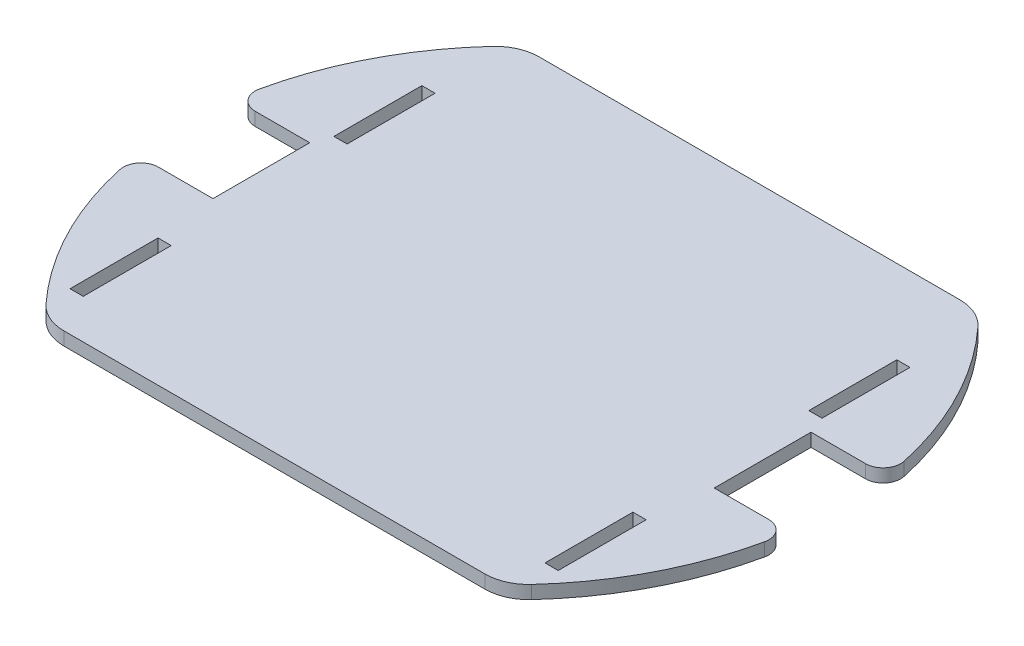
ISO-10303-21;
HEADER;
FILE_DESCRIPTION(('STEP AP214'),'2;1');
FILE_NAME('part.step','',(''),(''),'','','');
FILE_SCHEMA(('AUTOMOTIVE_DESIGN { 1 0 10303 214 1 1 1 1 }'));
ENDSEC;
DATA;
#1=APPLICATION_CONTEXT('core data for automotive mechanical design processes');
#2=APPLICATION_PROTOCOL_DEFINITION('international standard','automotive_design',2000,#1);
#3=PRODUCT_CONTEXT('',#1,'mechanical');
#4=PRODUCT('Part','Part','',(#3));
#5=PRODUCT_RELATED_PRODUCT_CATEGORY('part','',(#4));
#6=PRODUCT_DEFINITION_FORMATION('','',#4);
#7=PRODUCT_DEFINITION_CONTEXT('part definition',#1,'design');
#8=PRODUCT_DEFINITION('design','',#6,#7);
#9=PRODUCT_DEFINITION_SHAPE('','',#8);
#10=(LENGTH_UNIT() NAMED_UNIT(*) SI_UNIT(.MILLI.,.METRE.));
#11=(NAMED_UNIT(*) PLANE_ANGLE_UNIT() SI_UNIT($,.RADIAN.));
#12=(NAMED_UNIT(*) SI_UNIT($,.STERADIAN.) SOLID_ANGLE_UNIT());
#13=UNCERTAINTY_MEASURE_WITH_UNIT(LENGTH_MEASURE(1.E-05),#10,'distance_accuracy_value','');
#14=(GEOMETRIC_REPRESENTATION_CONTEXT(3) GLOBAL_UNCERTAINTY_ASSIGNED_CONTEXT((#13)) GLOBAL_UNIT_ASSIGNED_CONTEXT((#10,
#11,#12)) REPRESENTATION_CONTEXT('',''));
#15=CARTESIAN_POINT('',(0.,0.,0.));
#16=DIRECTION('',(0.,0.,1.));
#17=DIRECTION('',(1.,0.,0.));
#18=AXIS2_PLACEMENT_3D('',#15,#16,#17);
#19=CARTESIAN_POINT('',(0.,3.,0.));
#20=DIRECTION('',(0.,-1.,0.));
#21=DIRECTION('',(0.,0.,-1.));
#22=AXIS2_PLACEMENT_3D('',#19,#20,#21);
#23=CYLINDRICAL_SURFACE('',#22,75.);
#24=CARTESIAN_POINT('',(0.,3.,0.));
#25=DIRECTION('',(0.,1.,0.));
#26=DIRECTION('',(0.,0.,1.));
#27=AXIS2_PLACEMENT_3D('',#24,#25,#26);
#28=CIRCLE('',#27,75.);
#29=CARTESIAN_POINT('',(73.307119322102,3.,-15.8450704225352));
#30=VERTEX_POINT('',#29);
#31=CARTESIAN_POINT('',(55.2040325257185,3.,-50.7692307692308));
#32=VERTEX_POINT('',#31);
#33=EDGE_CURVE('E367',#30,#32,#28,.T.);
#34=ORIENTED_EDGE('',*,*,#33,.F.);
#35=DIRECTION('',(0.,-1.,0.));
#36=VECTOR('',#35,1.);
#37=CARTESIAN_POINT('',(73.307119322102,3.,-15.8450704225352));
#38=LINE('',#37,#36);
#39=CARTESIAN_POINT('',(73.307119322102,0.,-15.8450704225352));
#40=VERTEX_POINT('',#39);
#41=EDGE_CURVE('E46',#30,#40,#38,.T.);
#42=ORIENTED_EDGE('',*,*,#41,.T.);
#43=CARTESIAN_POINT('',(0.,0.,0.));
#44=DIRECTION('',(0.,1.,0.));
#45=DIRECTION('',(0.,0.,1.));
#46=AXIS2_PLACEMENT_3D('',#43,#44,#45);
#47=CIRCLE('',#46,75.);
#48=CARTESIAN_POINT('',(55.2040325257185,0.,-50.7692307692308));
#49=VERTEX_POINT('',#48);
#50=EDGE_CURVE('E360',#40,#49,#47,.T.);
#51=ORIENTED_EDGE('',*,*,#50,.T.);
#52=DIRECTION('',(0.,-1.,0.));
#53=VECTOR('',#52,1.);
#54=CARTESIAN_POINT('',(55.2040325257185,3.,-50.7692307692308));
#55=LINE('',#54,#53);
#56=EDGE_CURVE('E518',#49,#32,#55,.F.);
#57=ORIENTED_EDGE('',*,*,#56,.T.);
#58=EDGE_LOOP('',(#34,#42,#51,#57));
#59=FACE_BOUND('',#58,.T.);
#60=ADVANCED_FACE('F38',(#59),#23,.T.);
#61=CARTESIAN_POINT('',(-52.0480547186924,3.,-54.));
#62=DIRECTION('',(0.,0.,1.));
#63=DIRECTION('',(1.,0.,0.));
#64=AXIS2_PLACEMENT_3D('',#61,#62,#63);
#65=PLANE('',#64);
#66=DIRECTION('',(-1.,0.,0.));
#67=VECTOR('',#66,1.);
#68=CARTESIAN_POINT('',(-52.0480547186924,0.,-54.));
#69=LINE('',#68,#67);
#70=CARTESIAN_POINT('',(47.8434948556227,0.,-54.));
#71=VERTEX_POINT('',#70);
#72=CARTESIAN_POINT('',(-47.8434948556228,0.,-54.));
#73=VERTEX_POINT('',#72);
#74=EDGE_CURVE('E399',#71,#73,#69,.T.);
#75=ORIENTED_EDGE('',*,*,#74,.T.);
#76=DIRECTION('',(0.,-1.,0.));
#77=VECTOR('',#76,1.);
#78=CARTESIAN_POINT('',(-47.8434948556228,3.,-54.));
#79=LINE('',#78,#77);
#80=CARTESIAN_POINT('',(-47.8434948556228,3.,-54.));
#81=VERTEX_POINT('',#80);
#82=EDGE_CURVE('E497',#73,#81,#79,.F.);
#83=ORIENTED_EDGE('',*,*,#82,.T.);
#84=DIRECTION('',(-1.,0.,0.));
#85=VECTOR('',#84,1.);
#86=CARTESIAN_POINT('',(-52.0480547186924,3.,-54.));
#87=LINE('',#86,#85);
#88=CARTESIAN_POINT('',(47.8434948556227,3.,-54.));
#89=VERTEX_POINT('',#88);
#90=EDGE_CURVE('E369',#89,#81,#87,.T.);
#91=ORIENTED_EDGE('',*,*,#90,.F.);
#92=DIRECTION('',(0.,-1.,0.));
#93=VECTOR('',#92,1.);
#94=CARTESIAN_POINT('',(47.8434948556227,3.,-54.));
#95=LINE('',#94,#93);
#96=EDGE_CURVE('E494',#89,#71,#95,.T.);
#97=ORIENTED_EDGE('',*,*,#96,.T.);
#98=EDGE_LOOP('',(#75,#83,#91,#97));
#99=FACE_BOUND('',#98,.T.);
#100=ADVANCED_FACE('F568',(#99),#65,.F.);
#101=CARTESIAN_POINT('',(0.,3.,0.));
#102=DIRECTION('',(0.,-1.,0.));
#103=DIRECTION('',(0.,0.,-1.));
#104=AXIS2_PLACEMENT_3D('',#101,#102,#103);
#105=CYLINDRICAL_SURFACE('',#104,75.);
#106=CARTESIAN_POINT('',(0.,0.,0.));
#107=DIRECTION('',(0.,1.,0.));
#108=DIRECTION('',(0.,0.,1.));
#109=AXIS2_PLACEMENT_3D('',#106,#107,#108);
#110=CIRCLE('',#109,75.);
#111=CARTESIAN_POINT('',(-55.2040325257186,0.,-50.7692307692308));
#112=VERTEX_POINT('',#111);
#113=CARTESIAN_POINT('',(-73.307119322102,0.,-15.8450704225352));
#114=VERTEX_POINT('',#113);
#115=EDGE_CURVE('E402',#112,#114,#110,.T.);
#116=ORIENTED_EDGE('',*,*,#115,.T.);
#117=DIRECTION('',(0.,-1.,0.));
#118=VECTOR('',#117,1.);
#119=CARTESIAN_POINT('',(-73.307119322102,3.,-15.8450704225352));
#120=LINE('',#119,#118);
#121=CARTESIAN_POINT('',(-73.307119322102,3.,-15.8450704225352));
#122=VERTEX_POINT('',#121);
#123=EDGE_CURVE('E544',#114,#122,#120,.F.);
#124=ORIENTED_EDGE('',*,*,#123,.T.);
#125=CARTESIAN_POINT('',(0.,3.,0.));
#126=DIRECTION('',(0.,1.,0.));
#127=DIRECTION('',(0.,0.,1.));
#128=AXIS2_PLACEMENT_3D('',#125,#126,#127);
#129=CIRCLE('',#128,75.);
#130=CARTESIAN_POINT('',(-55.2040325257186,3.,-50.7692307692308));
#131=VERTEX_POINT('',#130);
#132=EDGE_CURVE('E373',#131,#122,#129,.T.);
#133=ORIENTED_EDGE('',*,*,#132,.F.);
#134=DIRECTION('',(0.,-1.,0.));
#135=VECTOR('',#134,1.);
#136=CARTESIAN_POINT('',(-55.2040325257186,3.,-50.7692307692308));
#137=LINE('',#136,#135);
#138=EDGE_CURVE('E481',#131,#112,#137,.T.);
#139=ORIENTED_EDGE('',*,*,#138,.T.);
#140=EDGE_LOOP('',(#116,#124,#133,#139));
#141=FACE_BOUND('',#140,.T.);
#142=ADVANCED_FACE('F576',(#141),#105,.T.);
#143=CARTESIAN_POINT('',(-74.1889479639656,3.,-11.));
#144=DIRECTION('',(0.,0.,-1.));
#145=DIRECTION('',(-1.,0.,0.));
#146=AXIS2_PLACEMENT_3D('',#143,#144,#145);
#147=PLANE('',#146);
#148=DIRECTION('',(1.,0.,0.));
#149=VECTOR('',#148,1.);
#150=CARTESIAN_POINT('',(-74.1889479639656,3.,-11.));
#151=LINE('',#150,#149);
#152=CARTESIAN_POINT('',(-69.3974062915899,3.,-11.));
#153=VERTEX_POINT('',#152);
#154=CARTESIAN_POINT('',(-57.,3.,-11.));
#155=VERTEX_POINT('',#154);
#156=EDGE_CURVE('E376',#153,#155,#151,.T.);
#157=ORIENTED_EDGE('',*,*,#156,.F.);
#158=DIRECTION('',(0.,-1.,0.));
#159=VECTOR('',#158,1.);
#160=CARTESIAN_POINT('',(-69.3974062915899,3.,-11.));
#161=LINE('',#160,#159);
#162=CARTESIAN_POINT('',(-69.3974062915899,0.,-11.));
#163=VERTEX_POINT('',#162);
#164=EDGE_CURVE('E541',#153,#163,#161,.T.);
#165=ORIENTED_EDGE('',*,*,#164,.T.);
#166=DIRECTION('',(1.,0.,0.));
#167=VECTOR('',#166,1.);
#168=CARTESIAN_POINT('',(-74.1889479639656,0.,-11.));
#169=LINE('',#168,#167);
#170=CARTESIAN_POINT('',(-57.,0.,-11.));
#171=VERTEX_POINT('',#170);
#172=EDGE_CURVE('E405',#163,#171,#169,.T.);
#173=ORIENTED_EDGE('',*,*,#172,.T.);
#174=DIRECTION('',(0.,-1.,0.));
#175=VECTOR('',#174,1.);
#176=CARTESIAN_POINT('',(-57.,3.,-11.));
#177=LINE('',#176,#175);
#178=EDGE_CURVE('E433',#155,#171,#177,.T.);
#179=ORIENTED_EDGE('',*,*,#178,.F.);
#180=EDGE_LOOP('',(#157,#165,#173,#179));
#181=FACE_BOUND('',#180,.T.);
#182=ADVANCED_FACE('F585',(#181),#147,.F.);
#183=CARTESIAN_POINT('',(-57.,3.,-11.));
#184=DIRECTION('',(1.,0.,0.));
#185=DIRECTION('',(0.,0.,-1.));
#186=AXIS2_PLACEMENT_3D('',#183,#184,#185);
#187=PLANE('',#186);
#188=DIRECTION('',(0.,0.,1.));
#189=VECTOR('',#188,1.);
#190=CARTESIAN_POINT('',(-57.,0.,-11.));
#191=LINE('',#190,#189);
#192=CARTESIAN_POINT('',(-57.,0.,11.));
#193=VERTEX_POINT('',#192);
#194=EDGE_CURVE('E407',#171,#193,#191,.T.);
#195=ORIENTED_EDGE('',*,*,#194,.T.);
#196=DIRECTION('',(0.,-1.,0.));
#197=VECTOR('',#196,1.);
#198=CARTESIAN_POINT('',(-57.,3.,11.));
#199=LINE('',#198,#197);
#200=CARTESIAN_POINT('',(-57.,3.,11.));
#201=VERTEX_POINT('',#200);
#202=EDGE_CURVE('E430',#201,#193,#199,.T.);
#203=ORIENTED_EDGE('',*,*,#202,.F.);
#204=DIRECTION('',(0.,0.,1.));
#205=VECTOR('',#204,1.);
#206=CARTESIAN_POINT('',(-57.,3.,-11.));
#207=LINE('',#206,#205);
#208=EDGE_CURVE('E378',#155,#201,#207,.T.);
#209=ORIENTED_EDGE('',*,*,#208,.F.);
#210=ORIENTED_EDGE('',*,*,#178,.T.);
#211=EDGE_LOOP('',(#195,#203,#209,#210));
#212=FACE_BOUND('',#211,.T.);
#213=ADVANCED_FACE('F591',(#212),#187,.F.);
#214=CARTESIAN_POINT('',(-57.,3.,11.));
#215=DIRECTION('',(0.,0.,1.));
#216=DIRECTION('',(1.,0.,0.));
#217=AXIS2_PLACEMENT_3D('',#214,#215,#216);
#218=PLANE('',#217);
#219=DIRECTION('',(-1.,0.,0.));
#220=VECTOR('',#219,1.);
#221=CARTESIAN_POINT('',(-57.,0.,11.));
#222=LINE('',#221,#220);
#223=CARTESIAN_POINT('',(-69.3974062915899,0.,11.));
#224=VERTEX_POINT('',#223);
#225=EDGE_CURVE('E409',#193,#224,#222,.T.);
#226=ORIENTED_EDGE('',*,*,#225,.T.);
#227=DIRECTION('',(0.,-1.,0.));
#228=VECTOR('',#227,1.);
#229=CARTESIAN_POINT('',(-69.3974062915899,3.,11.));
#230=LINE('',#229,#228);
#231=CARTESIAN_POINT('',(-69.3974062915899,3.,11.));
#232=VERTEX_POINT('',#231);
#233=EDGE_CURVE('E532',#224,#232,#230,.F.);
#234=ORIENTED_EDGE('',*,*,#233,.T.);
#235=DIRECTION('',(-1.,0.,0.));
#236=VECTOR('',#235,1.);
#237=CARTESIAN_POINT('',(-57.,3.,11.));
#238=LINE('',#237,#236);
#239=EDGE_CURVE('E380',#201,#232,#238,.T.);
#240=ORIENTED_EDGE('',*,*,#239,.F.);
#241=ORIENTED_EDGE('',*,*,#202,.T.);
#242=EDGE_LOOP('',(#226,#234,#240,#241));
#243=FACE_BOUND('',#242,.T.);
#244=ADVANCED_FACE('F901',(#243),#218,.F.);
#245=CARTESIAN_POINT('',(0.,3.,0.));
#246=DIRECTION('',(0.,-1.,0.));
#247=DIRECTION('',(0.,0.,-1.));
#248=AXIS2_PLACEMENT_3D('',#245,#246,#247);
#249=CYLINDRICAL_SURFACE('',#248,75.);
#250=CARTESIAN_POINT('',(0.,3.,0.));
#251=DIRECTION('',(0.,1.,0.));
#252=DIRECTION('',(0.,0.,1.));
#253=AXIS2_PLACEMENT_3D('',#250,#251,#252);
#254=CIRCLE('',#253,75.);
#255=CARTESIAN_POINT('',(-73.307119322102,3.,15.8450704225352));
#256=VERTEX_POINT('',#255);
#257=CARTESIAN_POINT('',(-55.2040325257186,3.,50.7692307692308));
#258=VERTEX_POINT('',#257);
#259=EDGE_CURVE('E383',#256,#258,#254,.T.);
#260=ORIENTED_EDGE('',*,*,#259,.F.);
#261=DIRECTION('',(0.,-1.,0.));
#262=VECTOR('',#261,1.);
#263=CARTESIAN_POINT('',(-73.307119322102,3.,15.8450704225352));
#264=LINE('',#263,#262);
#265=CARTESIAN_POINT('',(-73.307119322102,0.,15.8450704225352));
#266=VERTEX_POINT('',#265);
#267=EDGE_CURVE('E521',#256,#266,#264,.T.);
#268=ORIENTED_EDGE('',*,*,#267,.T.);
#269=CARTESIAN_POINT('',(0.,0.,0.));
#270=DIRECTION('',(0.,1.,0.));
#271=DIRECTION('',(0.,0.,1.));
#272=AXIS2_PLACEMENT_3D('',#269,#270,#271);
#273=CIRCLE('',#272,75.);
#274=CARTESIAN_POINT('',(-55.2040325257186,0.,50.7692307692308));
#275=VERTEX_POINT('',#274);
#276=EDGE_CURVE('E412',#266,#275,#273,.T.);
#277=ORIENTED_EDGE('',*,*,#276,.T.);
#278=DIRECTION('',(0.,-1.,0.));
#279=VECTOR('',#278,1.);
#280=CARTESIAN_POINT('',(-55.2040325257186,3.,50.7692307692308));
#281=LINE('',#280,#279);
#282=EDGE_CURVE('E512',#275,#258,#281,.F.);
#283=ORIENTED_EDGE('',*,*,#282,.T.);
#284=EDGE_LOOP('',(#260,#268,#277,#283));
#285=FACE_BOUND('',#284,.T.);
#286=ADVANCED_FACE('F601',(#285),#249,.T.);
#287=CARTESIAN_POINT('',(-52.0480547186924,3.,54.));
#288=DIRECTION('',(0.,0.,-1.));
#289=DIRECTION('',(-1.,0.,0.));
#290=AXIS2_PLACEMENT_3D('',#287,#288,#289);
#291=PLANE('',#290);
#292=DIRECTION('',(1.,0.,0.));
#293=VECTOR('',#292,1.);
#294=CARTESIAN_POINT('',(-52.0480547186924,3.,54.));
#295=LINE('',#294,#293);
#296=CARTESIAN_POINT('',(-47.8434948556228,3.,54.));
#297=VERTEX_POINT('',#296);
#298=CARTESIAN_POINT('',(47.8434948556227,3.,54.));
#299=VERTEX_POINT('',#298);
#300=EDGE_CURVE('E385',#297,#299,#295,.T.);
#301=ORIENTED_EDGE('',*,*,#300,.F.);
#302=DIRECTION('',(0.,-1.,0.));
#303=VECTOR('',#302,1.);
#304=CARTESIAN_POINT('',(-47.8434948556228,3.,54.));
#305=LINE('',#304,#303);
#306=CARTESIAN_POINT('',(-47.8434948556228,0.,54.));
#307=VERTEX_POINT('',#306);
#308=EDGE_CURVE('E509',#297,#307,#305,.T.);
#309=ORIENTED_EDGE('',*,*,#308,.T.);
#310=DIRECTION('',(1.,0.,0.));
#311=VECTOR('',#310,1.);
#312=CARTESIAN_POINT('',(-52.0480547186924,0.,54.));
#313=LINE('',#312,#311);
#314=CARTESIAN_POINT('',(47.8434948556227,0.,54.));
#315=VERTEX_POINT('',#314);
#316=EDGE_CURVE('E414',#307,#315,#313,.T.);
#317=ORIENTED_EDGE('',*,*,#316,.T.);
#318=DIRECTION('',(0.,-1.,0.));
#319=VECTOR('',#318,1.);
#320=CARTESIAN_POINT('',(47.8434948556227,3.,54.));
#321=LINE('',#320,#319);
#322=EDGE_CURVE('E507',#315,#299,#321,.F.);
#323=ORIENTED_EDGE('',*,*,#322,.T.);
#324=EDGE_LOOP('',(#301,#309,#317,#323));
#325=FACE_BOUND('',#324,.T.);
#326=ADVANCED_FACE('F612',(#325),#291,.F.);
#327=CARTESIAN_POINT('',(0.,3.,0.));
#328=DIRECTION('',(0.,-1.,0.));
#329=DIRECTION('',(0.,0.,-1.));
#330=AXIS2_PLACEMENT_3D('',#327,#328,#329);
#331=CYLINDRICAL_SURFACE('',#330,75.);
#332=CARTESIAN_POINT('',(0.,0.,0.));
#333=DIRECTION('',(0.,1.,0.));
#334=DIRECTION('',(0.,0.,1.));
#335=AXIS2_PLACEMENT_3D('',#332,#333,#334);
#336=CIRCLE('',#335,75.);
#337=CARTESIAN_POINT('',(55.2040325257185,0.,50.7692307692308));
#338=VERTEX_POINT('',#337);
#339=CARTESIAN_POINT('',(73.307119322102,0.,15.8450704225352));
#340=VERTEX_POINT('',#339);
#341=EDGE_CURVE('E417',#338,#340,#336,.T.);
#342=ORIENTED_EDGE('',*,*,#341,.T.);
#343=DIRECTION('',(0.,-1.,0.));
#344=VECTOR('',#343,1.);
#345=CARTESIAN_POINT('',(73.307119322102,3.,15.8450704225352));
#346=LINE('',#345,#344);
#347=CARTESIAN_POINT('',(73.307119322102,3.,15.8450704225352));
#348=VERTEX_POINT('',#347);
#349=EDGE_CURVE('E549',#340,#348,#346,.F.);
#350=ORIENTED_EDGE('',*,*,#349,.T.);
#351=CARTESIAN_POINT('',(0.,3.,0.));
#352=DIRECTION('',(0.,1.,0.));
#353=DIRECTION('',(0.,0.,1.));
#354=AXIS2_PLACEMENT_3D('',#351,#352,#353);
#355=CIRCLE('',#354,75.);
#356=CARTESIAN_POINT('',(55.2040325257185,3.,50.7692307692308));
#357=VERTEX_POINT('',#356);
#358=EDGE_CURVE('E388',#357,#348,#355,.T.);
#359=ORIENTED_EDGE('',*,*,#358,.F.);
#360=DIRECTION('',(0.,-1.,0.));
#361=VECTOR('',#360,1.);
#362=CARTESIAN_POINT('',(55.2040325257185,3.,50.7692307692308));
#363=LINE('',#362,#361);
#364=EDGE_CURVE('E515',#357,#338,#363,.T.);
#365=ORIENTED_EDGE('',*,*,#364,.T.);
#366=EDGE_LOOP('',(#342,#350,#359,#365));
#367=FACE_BOUND('',#366,.T.);
#368=ADVANCED_FACE('F620',(#367),#331,.T.);
#369=CARTESIAN_POINT('',(57.,3.,11.));
#370=DIRECTION('',(0.,0.,1.));
#371=DIRECTION('',(1.,0.,0.));
#372=AXIS2_PLACEMENT_3D('',#369,#370,#371);
#373=PLANE('',#372);
#374=DIRECTION('',(-1.,0.,0.));
#375=VECTOR('',#374,1.);
#376=CARTESIAN_POINT('',(57.,3.,11.));
#377=LINE('',#376,#375);
#378=CARTESIAN_POINT('',(69.3974062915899,3.,11.));
#379=VERTEX_POINT('',#378);
#380=CARTESIAN_POINT('',(57.,3.,11.));
#381=VERTEX_POINT('',#380);
#382=EDGE_CURVE('E391',#379,#381,#377,.T.);
#383=ORIENTED_EDGE('',*,*,#382,.F.);
#384=DIRECTION('',(0.,-1.,0.));
#385=VECTOR('',#384,1.);
#386=CARTESIAN_POINT('',(69.3974062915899,3.,11.));
#387=LINE('',#386,#385);
#388=CARTESIAN_POINT('',(69.3974062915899,0.,11.));
#389=VERTEX_POINT('',#388);
#390=EDGE_CURVE('E546',#379,#389,#387,.T.);
#391=ORIENTED_EDGE('',*,*,#390,.T.);
#392=DIRECTION('',(-1.,0.,0.));
#393=VECTOR('',#392,1.);
#394=CARTESIAN_POINT('',(57.,0.,11.));
#395=LINE('',#394,#393);
#396=CARTESIAN_POINT('',(57.,0.,11.));
#397=VERTEX_POINT('',#396);
#398=EDGE_CURVE('E420',#389,#397,#395,.T.);
#399=ORIENTED_EDGE('',*,*,#398,.T.);
#400=DIRECTION('',(0.,-1.,0.));
#401=VECTOR('',#400,1.);
#402=CARTESIAN_POINT('',(57.,3.,11.));
#403=LINE('',#402,#401);
#404=EDGE_CURVE('E427',#381,#397,#403,.T.);
#405=ORIENTED_EDGE('',*,*,#404,.F.);
#406=EDGE_LOOP('',(#383,#391,#399,#405));
#407=FACE_BOUND('',#406,.T.);
#408=ADVANCED_FACE('F629',(#407),#373,.F.);
#409=CARTESIAN_POINT('',(57.,3.,-11.));
#410=DIRECTION('',(-1.,0.,0.));
#411=DIRECTION('',(0.,0.,1.));
#412=AXIS2_PLACEMENT_3D('',#409,#410,#411);
#413=PLANE('',#412);
#414=DIRECTION('',(0.,0.,-1.));
#415=VECTOR('',#414,1.);
#416=CARTESIAN_POINT('',(57.,0.,-11.));
#417=LINE('',#416,#415);
#418=CARTESIAN_POINT('',(57.,0.,-11.));
#419=VERTEX_POINT('',#418);
#420=EDGE_CURVE('E422',#397,#419,#417,.T.);
#421=ORIENTED_EDGE('',*,*,#420,.T.);
#422=DIRECTION('',(0.,-1.,0.));
#423=VECTOR('',#422,1.);
#424=CARTESIAN_POINT('',(57.,3.,-11.));
#425=LINE('',#424,#423);
#426=CARTESIAN_POINT('',(57.,3.,-11.));
#427=VERTEX_POINT('',#426);
#428=EDGE_CURVE('E397',#427,#419,#425,.T.);
#429=ORIENTED_EDGE('',*,*,#428,.F.);
#430=DIRECTION('',(0.,0.,-1.));
#431=VECTOR('',#430,1.);
#432=CARTESIAN_POINT('',(57.,3.,-11.));
#433=LINE('',#432,#431);
#434=EDGE_CURVE('E393',#381,#427,#433,.T.);
#435=ORIENTED_EDGE('',*,*,#434,.F.);
#436=ORIENTED_EDGE('',*,*,#404,.T.);
#437=EDGE_LOOP('',(#421,#429,#435,#436));
#438=FACE_BOUND('',#437,.T.);
#439=ADVANCED_FACE('F635',(#438),#413,.F.);
#440=CARTESIAN_POINT('',(74.1889479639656,3.,-11.));
#441=DIRECTION('',(0.,0.,-1.));
#442=DIRECTION('',(-1.,0.,0.));
#443=AXIS2_PLACEMENT_3D('',#440,#441,#442);
#444=PLANE('',#443);
#445=DIRECTION('',(1.,0.,0.));
#446=VECTOR('',#445,1.);
#447=CARTESIAN_POINT('',(74.1889479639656,0.,-11.));
#448=LINE('',#447,#446);
#449=CARTESIAN_POINT('',(69.3974062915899,0.,-11.));
#450=VERTEX_POINT('',#449);
#451=EDGE_CURVE('E370',#419,#450,#448,.T.);
#452=ORIENTED_EDGE('',*,*,#451,.T.);
#453=DIRECTION('',(0.,-1.,0.));
#454=VECTOR('',#453,1.);
#455=CARTESIAN_POINT('',(69.3974062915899,3.,-11.));
#456=LINE('',#455,#454);
#457=CARTESIAN_POINT('',(69.3974062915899,3.,-11.));
#458=VERTEX_POINT('',#457);
#459=EDGE_CURVE('E11',#450,#458,#456,.F.);
#460=ORIENTED_EDGE('',*,*,#459,.T.);
#461=DIRECTION('',(1.,0.,0.));
#462=VECTOR('',#461,1.);
#463=CARTESIAN_POINT('',(74.1889479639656,3.,-11.));
#464=LINE('',#463,#462);
#465=EDGE_CURVE('E395',#427,#458,#464,.T.);
#466=ORIENTED_EDGE('',*,*,#465,.F.);
#467=ORIENTED_EDGE('',*,*,#428,.T.);
#468=EDGE_LOOP('',(#452,#460,#466,#467));
#469=FACE_BOUND('',#468,.T.);
#470=ADVANCED_FACE('F858',(#469),#444,.F.);
#471=CARTESIAN_POINT('',(0.,3.,0.));
#472=DIRECTION('',(0.,1.,0.));
#473=DIRECTION('',(0.,0.,1.));
#474=AXIS2_PLACEMENT_3D('',#471,#472,#473);
#475=PLANE('',#474);
#476=DIRECTION('',(0.,0.,1.));
#477=VECTOR('',#476,1.);
#478=CARTESIAN_POINT('',(52.5,3.,25.));
#479=LINE('',#478,#477);
#480=CARTESIAN_POINT('',(52.5,3.,25.));
#481=VERTEX_POINT('',#480);
#482=CARTESIAN_POINT('',(52.5,3.,45.));
#483=VERTEX_POINT('',#482);
#484=EDGE_CURVE('E307',#481,#483,#479,.T.);
#485=ORIENTED_EDGE('',*,*,#484,.F.);
#486=DIRECTION('',(-1.,0.,0.));
#487=VECTOR('',#486,1.);
#488=CARTESIAN_POINT('',(52.5,3.,25.));
#489=LINE('',#488,#487);
#490=CARTESIAN_POINT('',(55.5,3.,25.));
#491=VERTEX_POINT('',#490);
#492=EDGE_CURVE('E316',#491,#481,#489,.T.);
#493=ORIENTED_EDGE('',*,*,#492,.F.);
#494=DIRECTION('',(0.,0.,-1.));
#495=VECTOR('',#494,1.);
#496=CARTESIAN_POINT('',(55.5,3.,25.));
#497=LINE('',#496,#495);
#498=CARTESIAN_POINT('',(55.5,3.,45.));
#499=VERTEX_POINT('',#498);
#500=EDGE_CURVE('E313',#499,#491,#497,.T.);
#501=ORIENTED_EDGE('',*,*,#500,.F.);
#502=DIRECTION('',(1.,0.,0.));
#503=VECTOR('',#502,1.);
#504=CARTESIAN_POINT('',(52.5,3.,45.));
#505=LINE('',#504,#503);
#506=EDGE_CURVE('E309',#483,#499,#505,.T.);
#507=ORIENTED_EDGE('',*,*,#506,.F.);
#508=EDGE_LOOP('',(#485,#493,#501,#507));
#509=FACE_BOUND('',#508,.T.);
#510=DIRECTION('',(-1.,0.,0.));
#511=VECTOR('',#510,1.);
#512=CARTESIAN_POINT('',(-52.5,3.,-35.));
#513=LINE('',#512,#511);
#514=CARTESIAN_POINT('',(-52.5,3.,-35.));
#515=VERTEX_POINT('',#514);
#516=CARTESIAN_POINT('',(-55.5,3.,-35.));
#517=VERTEX_POINT('',#516);
#518=EDGE_CURVE('E304',#515,#517,#513,.T.);
#519=ORIENTED_EDGE('',*,*,#518,.F.);
#520=DIRECTION('',(0.,0.,-1.));
#521=VECTOR('',#520,1.);
#522=CARTESIAN_POINT('',(-52.5,3.,-35.));
#523=LINE('',#522,#521);
#524=CARTESIAN_POINT('',(-52.5,3.,-15.));
#525=VERTEX_POINT('',#524);
#526=EDGE_CURVE('E336',#525,#515,#523,.T.);
#527=ORIENTED_EDGE('',*,*,#526,.F.);
#528=DIRECTION('',(1.,0.,0.));
#529=VECTOR('',#528,1.);
#530=CARTESIAN_POINT('',(-52.5,3.,-15.));
#531=LINE('',#530,#529);
#532=CARTESIAN_POINT('',(-55.5,3.,-15.));
#533=VERTEX_POINT('',#532);
#534=EDGE_CURVE('E333',#533,#525,#531,.T.);
#535=ORIENTED_EDGE('',*,*,#534,.F.);
#536=DIRECTION('',(0.,0.,1.));
#537=VECTOR('',#536,1.);
#538=CARTESIAN_POINT('',(-55.5,3.,-35.));
#539=LINE('',#538,#537);
#540=EDGE_CURVE('E330',#517,#533,#539,.T.);
#541=ORIENTED_EDGE('',*,*,#540,.F.);
#542=EDGE_LOOP('',(#519,#527,#535,#541));
#543=FACE_BOUND('',#542,.T.);
#544=DIRECTION('',(-1.,0.,0.));
#545=VECTOR('',#544,1.);
#546=CARTESIAN_POINT('',(-52.5,3.,25.));
#547=LINE('',#546,#545);
#548=CARTESIAN_POINT('',(-52.5,3.,25.));
#549=VERTEX_POINT('',#548);
#550=CARTESIAN_POINT('',(-55.5,3.,25.));
#551=VERTEX_POINT('',#550);
#552=EDGE_CURVE('E292',#549,#551,#547,.T.);
#553=ORIENTED_EDGE('',*,*,#552,.F.);
#554=DIRECTION('',(0.,0.,-1.));
#555=VECTOR('',#554,1.);
#556=CARTESIAN_POINT('',(-52.5,3.,25.));
#557=LINE('',#556,#555);
#558=CARTESIAN_POINT('',(-52.5,3.,45.));
#559=VERTEX_POINT('',#558);
#560=EDGE_CURVE('E297',#559,#549,#557,.T.);
#561=ORIENTED_EDGE('',*,*,#560,.F.);
#562=DIRECTION('',(1.,0.,0.));
#563=VECTOR('',#562,1.);
#564=CARTESIAN_POINT('',(-52.5,3.,45.));
#565=LINE('',#564,#563);
#566=CARTESIAN_POINT('',(-55.5,3.,45.));
#567=VERTEX_POINT('',#566);
#568=EDGE_CURVE('E276',#567,#559,#565,.T.);
#569=ORIENTED_EDGE('',*,*,#568,.F.);
#570=DIRECTION('',(0.,0.,1.));
#571=VECTOR('',#570,1.);
#572=CARTESIAN_POINT('',(-55.5,3.,25.));
#573=LINE('',#572,#571);
#574=EDGE_CURVE('E287',#551,#567,#573,.T.);
#575=ORIENTED_EDGE('',*,*,#574,.F.);
#576=EDGE_LOOP('',(#553,#561,#569,#575));
#577=FACE_BOUND('',#576,.T.);
#578=DIRECTION('',(0.,0.,1.));
#579=VECTOR('',#578,1.);
#580=CARTESIAN_POINT('',(52.5,3.,-35.));
#581=LINE('',#580,#579);
#582=CARTESIAN_POINT('',(52.5,3.,-35.));
#583=VERTEX_POINT('',#582);
#584=CARTESIAN_POINT('',(52.5,3.,-15.));
#585=VERTEX_POINT('',#584);
#586=EDGE_CURVE('E322',#583,#585,#581,.T.);
#587=ORIENTED_EDGE('',*,*,#586,.F.);
#588=DIRECTION('',(-1.,0.,0.));
#589=VECTOR('',#588,1.);
#590=CARTESIAN_POINT('',(52.5,3.,-35.));
#591=LINE('',#590,#589);
#592=CARTESIAN_POINT('',(55.5,3.,-35.));
#593=VERTEX_POINT('',#592);
#594=EDGE_CURVE('E354',#593,#583,#591,.T.);
#595=ORIENTED_EDGE('',*,*,#594,.F.);
#596=DIRECTION('',(0.,0.,-1.));
#597=VECTOR('',#596,1.);
#598=CARTESIAN_POINT('',(55.5,3.,-35.));
#599=LINE('',#598,#597);
#600=CARTESIAN_POINT('',(55.5,3.,-15.));
#601=VERTEX_POINT('',#600);
#602=EDGE_CURVE('E351',#601,#593,#599,.T.);
#603=ORIENTED_EDGE('',*,*,#602,.F.);
#604=DIRECTION('',(1.,0.,0.));
#605=VECTOR('',#604,1.);
#606=CARTESIAN_POINT('',(52.5,3.,-15.));
#607=LINE('',#606,#605);
#608=EDGE_CURVE('E348',#585,#601,#607,.T.);
#609=ORIENTED_EDGE('',*,*,#608,.F.);
#610=EDGE_LOOP('',(#587,#595,#603,#609));
#611=FACE_BOUND('',#610,.T.);
#612=ORIENTED_EDGE('',*,*,#239,.T.);
#613=CARTESIAN_POINT('',(-69.3974062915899,3.,15.));
#614=DIRECTION('',(0.,1.,0.));
#615=DIRECTION('',(0.,0.,1.));
#616=AXIS2_PLACEMENT_3D('',#613,#614,#615);
#617=CIRCLE('',#616,4.);
#618=EDGE_CURVE('E539',#232,#256,#617,.T.);
#619=ORIENTED_EDGE('',*,*,#618,.T.);
#620=ORIENTED_EDGE('',*,*,#259,.T.);
#621=CARTESIAN_POINT('',(-47.8434948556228,3.,44.));
#622=DIRECTION('',(0.,1.,0.));
#623=DIRECTION('',(0.,0.,1.));
#624=AXIS2_PLACEMENT_3D('',#621,#622,#623);
#625=CIRCLE('',#624,10.);
#626=EDGE_CURVE('E503',#258,#297,#625,.T.);
#627=ORIENTED_EDGE('',*,*,#626,.T.);
#628=ORIENTED_EDGE('',*,*,#300,.T.);
#629=CARTESIAN_POINT('',(47.8434948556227,3.,44.));
#630=DIRECTION('',(0.,1.,0.));
#631=DIRECTION('',(0.,0.,1.));
#632=AXIS2_PLACEMENT_3D('',#629,#630,#631);
#633=CIRCLE('',#632,10.);
#634=EDGE_CURVE('E501',#299,#357,#633,.T.);
#635=ORIENTED_EDGE('',*,*,#634,.T.);
#636=ORIENTED_EDGE('',*,*,#358,.T.);
#637=CARTESIAN_POINT('',(69.3974062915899,3.,15.));
#638=DIRECTION('',(0.,1.,0.));
#639=DIRECTION('',(0.,0.,1.));
#640=AXIS2_PLACEMENT_3D('',#637,#638,#639);
#641=CIRCLE('',#640,4.);
#642=EDGE_CURVE('E535',#348,#379,#641,.T.);
#643=ORIENTED_EDGE('',*,*,#642,.T.);
#644=ORIENTED_EDGE('',*,*,#382,.T.);
#645=ORIENTED_EDGE('',*,*,#434,.T.);
#646=ORIENTED_EDGE('',*,*,#465,.T.);
#647=CARTESIAN_POINT('',(69.3974062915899,3.,-15.));
#648=DIRECTION('',(0.,1.,0.));
#649=DIRECTION('',(0.,0.,1.));
#650=AXIS2_PLACEMENT_3D('',#647,#648,#649);
#651=CIRCLE('',#650,4.);
#652=EDGE_CURVE('E53',#458,#30,#651,.T.);
#653=ORIENTED_EDGE('',*,*,#652,.T.);
#654=ORIENTED_EDGE('',*,*,#33,.T.);
#655=CARTESIAN_POINT('',(47.8434948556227,3.,-44.));
#656=DIRECTION('',(0.,1.,0.));
#657=DIRECTION('',(0.,0.,1.));
#658=AXIS2_PLACEMENT_3D('',#655,#656,#657);
#659=CIRCLE('',#658,10.);
#660=EDGE_CURVE('E499',#32,#89,#659,.T.);
#661=ORIENTED_EDGE('',*,*,#660,.T.);
#662=ORIENTED_EDGE('',*,*,#90,.T.);
#663=CARTESIAN_POINT('',(-47.8434948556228,3.,-44.));
#664=DIRECTION('',(0.,1.,0.));
#665=DIRECTION('',(0.,0.,1.));
#666=AXIS2_PLACEMENT_3D('',#663,#664,#665);
#667=CIRCLE('',#666,10.);
#668=EDGE_CURVE('E505',#81,#131,#667,.T.);
#669=ORIENTED_EDGE('',*,*,#668,.T.);
#670=ORIENTED_EDGE('',*,*,#132,.T.);
#671=CARTESIAN_POINT('',(-69.3974062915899,3.,-15.));
#672=DIRECTION('',(0.,1.,0.));
#673=DIRECTION('',(0.,0.,1.));
#674=AXIS2_PLACEMENT_3D('',#671,#672,#673);
#675=CIRCLE('',#674,4.);
#676=EDGE_CURVE('E537',#122,#153,#675,.T.);
#677=ORIENTED_EDGE('',*,*,#676,.T.);
#678=ORIENTED_EDGE('',*,*,#156,.T.);
#679=ORIENTED_EDGE('',*,*,#208,.T.);
#680=EDGE_LOOP('',(#612,#619,#620,#627,#628,#635,#636,#643,#644,#645,#646,#653,#654,#661,#662,
#669,#670,#677,#678,#679));
#681=FACE_BOUND('',#680,.T.);
#682=ADVANCED_FACE('F294',(#509,#543,#577,#611,#681),#475,.T.);
#683=CARTESIAN_POINT('',(0.,0.,0.));
#684=DIRECTION('',(0.,1.,0.));
#685=DIRECTION('',(0.,0.,1.));
#686=AXIS2_PLACEMENT_3D('',#683,#684,#685);
#687=PLANE('',#686);
#688=DIRECTION('',(-1.,0.,0.));
#689=VECTOR('',#688,1.);
#690=CARTESIAN_POINT('',(0.,0.,25.));
#691=LINE('',#690,#689);
#692=CARTESIAN_POINT('',(55.5,0.,25.));
#693=VERTEX_POINT('',#692);
#694=CARTESIAN_POINT('',(52.5,0.,25.));
#695=VERTEX_POINT('',#694);
#696=EDGE_CURVE('E475',#693,#695,#691,.T.);
#697=ORIENTED_EDGE('',*,*,#696,.T.);
#698=DIRECTION('',(0.,0.,1.));
#699=VECTOR('',#698,1.);
#700=CARTESIAN_POINT('',(52.5,0.,0.));
#701=LINE('',#700,#699);
#702=CARTESIAN_POINT('',(52.5,0.,45.));
#703=VERTEX_POINT('',#702);
#704=EDGE_CURVE('E478',#695,#703,#701,.T.);
#705=ORIENTED_EDGE('',*,*,#704,.T.);
#706=DIRECTION('',(1.,0.,0.));
#707=VECTOR('',#706,1.);
#708=CARTESIAN_POINT('',(0.,0.,45.));
#709=LINE('',#708,#707);
#710=CARTESIAN_POINT('',(55.5,0.,45.));
#711=VERTEX_POINT('',#710);
#712=EDGE_CURVE('E469',#703,#711,#709,.T.);
#713=ORIENTED_EDGE('',*,*,#712,.T.);
#714=DIRECTION('',(0.,0.,-1.));
#715=VECTOR('',#714,1.);
#716=CARTESIAN_POINT('',(55.5,0.,0.));
#717=LINE('',#716,#715);
#718=EDGE_CURVE('E472',#711,#693,#717,.T.);
#719=ORIENTED_EDGE('',*,*,#718,.T.);
#720=EDGE_LOOP('',(#697,#705,#713,#719));
#721=FACE_BOUND('',#720,.T.);
#722=DIRECTION('',(0.,0.,-1.));
#723=VECTOR('',#722,1.);
#724=CARTESIAN_POINT('',(-52.5,0.,0.));
#725=LINE('',#724,#723);
#726=CARTESIAN_POINT('',(-52.5,0.,-15.));
#727=VERTEX_POINT('',#726);
#728=CARTESIAN_POINT('',(-52.5,0.,-35.));
#729=VERTEX_POINT('',#728);
#730=EDGE_CURVE('E463',#727,#729,#725,.T.);
#731=ORIENTED_EDGE('',*,*,#730,.T.);
#732=DIRECTION('',(-1.,0.,0.));
#733=VECTOR('',#732,1.);
#734=CARTESIAN_POINT('',(0.,0.,-35.));
#735=LINE('',#734,#733);
#736=CARTESIAN_POINT('',(-55.5,0.,-35.));
#737=VERTEX_POINT('',#736);
#738=EDGE_CURVE('E466',#729,#737,#735,.T.);
#739=ORIENTED_EDGE('',*,*,#738,.T.);
#740=DIRECTION('',(0.,0.,1.));
#741=VECTOR('',#740,1.);
#742=CARTESIAN_POINT('',(-55.5,0.,0.));
#743=LINE('',#742,#741);
#744=CARTESIAN_POINT('',(-55.5,0.,-15.));
#745=VERTEX_POINT('',#744);
#746=EDGE_CURVE('E457',#737,#745,#743,.T.);
#747=ORIENTED_EDGE('',*,*,#746,.T.);
#748=DIRECTION('',(1.,0.,0.));
#749=VECTOR('',#748,1.);
#750=CARTESIAN_POINT('',(0.,0.,-15.));
#751=LINE('',#750,#749);
#752=EDGE_CURVE('E460',#745,#727,#751,.T.);
#753=ORIENTED_EDGE('',*,*,#752,.T.);
#754=EDGE_LOOP('',(#731,#739,#747,#753));
#755=FACE_BOUND('',#754,.T.);
#756=DIRECTION('',(0.,0.,-1.));
#757=VECTOR('',#756,1.);
#758=CARTESIAN_POINT('',(-52.5,0.,0.));
#759=LINE('',#758,#757);
#760=CARTESIAN_POINT('',(-52.5,0.,45.));
#761=VERTEX_POINT('',#760);
#762=CARTESIAN_POINT('',(-52.5,0.,25.));
#763=VERTEX_POINT('',#762);
#764=EDGE_CURVE('E451',#761,#763,#759,.T.);
#765=ORIENTED_EDGE('',*,*,#764,.T.);
#766=DIRECTION('',(-1.,0.,0.));
#767=VECTOR('',#766,1.);
#768=CARTESIAN_POINT('',(0.,0.,25.));
#769=LINE('',#768,#767);
#770=CARTESIAN_POINT('',(-55.5,0.,25.));
#771=VERTEX_POINT('',#770);
#772=EDGE_CURVE('E454',#763,#771,#769,.T.);
#773=ORIENTED_EDGE('',*,*,#772,.T.);
#774=DIRECTION('',(0.,0.,1.));
#775=VECTOR('',#774,1.);
#776=CARTESIAN_POINT('',(-55.5,0.,0.));
#777=LINE('',#776,#775);
#778=CARTESIAN_POINT('',(-55.5,0.,45.));
#779=VERTEX_POINT('',#778);
#780=EDGE_CURVE('E448',#771,#779,#777,.T.);
#781=ORIENTED_EDGE('',*,*,#780,.T.);
#782=DIRECTION('',(1.,0.,0.));
#783=VECTOR('',#782,1.);
#784=CARTESIAN_POINT('',(0.,0.,45.));
#785=LINE('',#784,#783);
#786=EDGE_CURVE('E279',#779,#761,#785,.T.);
#787=ORIENTED_EDGE('',*,*,#786,.T.);
#788=EDGE_LOOP('',(#765,#773,#781,#787));
#789=FACE_BOUND('',#788,.T.);
#790=DIRECTION('',(-1.,0.,0.));
#791=VECTOR('',#790,1.);
#792=CARTESIAN_POINT('',(0.,0.,-35.));
#793=LINE('',#792,#791);
#794=CARTESIAN_POINT('',(55.5,0.,-35.));
#795=VERTEX_POINT('',#794);
#796=CARTESIAN_POINT('',(52.5,0.,-35.));
#797=VERTEX_POINT('',#796);
#798=EDGE_CURVE('E442',#795,#797,#793,.T.);
#799=ORIENTED_EDGE('',*,*,#798,.T.);
#800=DIRECTION('',(0.,0.,1.));
#801=VECTOR('',#800,1.);
#802=CARTESIAN_POINT('',(52.5,0.,0.));
#803=LINE('',#802,#801);
#804=CARTESIAN_POINT('',(52.5,0.,-15.));
#805=VERTEX_POINT('',#804);
#806=EDGE_CURVE('E445',#797,#805,#803,.T.);
#807=ORIENTED_EDGE('',*,*,#806,.T.);
#808=DIRECTION('',(1.,0.,0.));
#809=VECTOR('',#808,1.);
#810=CARTESIAN_POINT('',(0.,0.,-15.));
#811=LINE('',#810,#809);
#812=CARTESIAN_POINT('',(55.5,0.,-15.));
#813=VERTEX_POINT('',#812);
#814=EDGE_CURVE('E436',#805,#813,#811,.T.);
#815=ORIENTED_EDGE('',*,*,#814,.T.);
#816=DIRECTION('',(0.,0.,-1.));
#817=VECTOR('',#816,1.);
#818=CARTESIAN_POINT('',(55.5,0.,0.));
#819=LINE('',#818,#817);
#820=EDGE_CURVE('E439',#813,#795,#819,.T.);
#821=ORIENTED_EDGE('',*,*,#820,.T.);
#822=EDGE_LOOP('',(#799,#807,#815,#821));
#823=FACE_BOUND('',#822,.T.);
#824=ORIENTED_EDGE('',*,*,#276,.F.);
#825=CARTESIAN_POINT('',(-69.3974062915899,0.,15.));
#826=DIRECTION('',(0.,1.,0.));
#827=DIRECTION('',(0.,0.,1.));
#828=AXIS2_PLACEMENT_3D('',#825,#826,#827);
#829=CIRCLE('',#828,4.);
#830=EDGE_CURVE('E530',#266,#224,#829,.F.);
#831=ORIENTED_EDGE('',*,*,#830,.T.);
#832=ORIENTED_EDGE('',*,*,#225,.F.);
#833=ORIENTED_EDGE('',*,*,#194,.F.);
#834=ORIENTED_EDGE('',*,*,#172,.F.);
#835=CARTESIAN_POINT('',(-69.3974062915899,0.,-15.));
#836=DIRECTION('',(0.,1.,0.));
#837=DIRECTION('',(0.,0.,1.));
#838=AXIS2_PLACEMENT_3D('',#835,#836,#837);
#839=CIRCLE('',#838,4.);
#840=EDGE_CURVE('E528',#163,#114,#839,.F.);
#841=ORIENTED_EDGE('',*,*,#840,.T.);
#842=ORIENTED_EDGE('',*,*,#115,.F.);
#843=CARTESIAN_POINT('',(-47.8434948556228,0.,-44.));
#844=DIRECTION('',(0.,1.,0.));
#845=DIRECTION('',(0.,0.,1.));
#846=AXIS2_PLACEMENT_3D('',#843,#844,#845);
#847=CIRCLE('',#846,10.);
#848=EDGE_CURVE('E492',#112,#73,#847,.F.);
#849=ORIENTED_EDGE('',*,*,#848,.T.);
#850=ORIENTED_EDGE('',*,*,#74,.F.);
#851=CARTESIAN_POINT('',(47.8434948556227,0.,-44.));
#852=DIRECTION('',(0.,1.,0.));
#853=DIRECTION('',(0.,0.,1.));
#854=AXIS2_PLACEMENT_3D('',#851,#852,#853);
#855=CIRCLE('',#854,10.);
#856=EDGE_CURVE('E484',#71,#49,#855,.F.);
#857=ORIENTED_EDGE('',*,*,#856,.T.);
#858=ORIENTED_EDGE('',*,*,#50,.F.);
#859=CARTESIAN_POINT('',(69.3974062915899,0.,-15.));
#860=DIRECTION('',(0.,1.,0.));
#861=DIRECTION('',(0.,0.,1.));
#862=AXIS2_PLACEMENT_3D('',#859,#860,#861);
#863=CIRCLE('',#862,4.);
#864=EDGE_CURVE('E524',#40,#450,#863,.F.);
#865=ORIENTED_EDGE('',*,*,#864,.T.);
#866=ORIENTED_EDGE('',*,*,#451,.F.);
#867=ORIENTED_EDGE('',*,*,#420,.F.);
#868=ORIENTED_EDGE('',*,*,#398,.F.);
#869=CARTESIAN_POINT('',(69.3974062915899,0.,15.));
#870=DIRECTION('',(0.,1.,0.));
#871=DIRECTION('',(0.,0.,1.));
#872=AXIS2_PLACEMENT_3D('',#869,#870,#871);
#873=CIRCLE('',#872,4.);
#874=EDGE_CURVE('E526',#389,#340,#873,.F.);
#875=ORIENTED_EDGE('',*,*,#874,.T.);
#876=ORIENTED_EDGE('',*,*,#341,.F.);
#877=CARTESIAN_POINT('',(47.8434948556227,0.,44.));
#878=DIRECTION('',(0.,1.,0.));
#879=DIRECTION('',(0.,0.,1.));
#880=AXIS2_PLACEMENT_3D('',#877,#878,#879);
#881=CIRCLE('',#880,10.);
#882=EDGE_CURVE('E487',#338,#315,#881,.F.);
#883=ORIENTED_EDGE('',*,*,#882,.T.);
#884=ORIENTED_EDGE('',*,*,#316,.F.);
#885=CARTESIAN_POINT('',(-47.8434948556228,0.,44.));
#886=DIRECTION('',(0.,1.,0.));
#887=DIRECTION('',(0.,0.,1.));
#888=AXIS2_PLACEMENT_3D('',#885,#886,#887);
#889=CIRCLE('',#888,10.);
#890=EDGE_CURVE('E489',#307,#275,#889,.F.);
#891=ORIENTED_EDGE('',*,*,#890,.T.);
#892=EDGE_LOOP('',(#824,#831,#832,#833,#834,#841,#842,#849,#850,#857,#858,#865,#866,#867,#868,
#875,#876,#883,#884,#891));
#893=FACE_BOUND('',#892,.T.);
#894=ADVANCED_FACE('F557',(#721,#755,#789,#823,#893),#687,.F.);
#895=CARTESIAN_POINT('',(52.5,-7.,-35.));
#896=DIRECTION('',(-1.,0.,0.));
#897=DIRECTION('',(0.,0.,1.));
#898=AXIS2_PLACEMENT_3D('',#895,#896,#897);
#899=PLANE('',#898);
#900=DIRECTION('',(0.,1.,0.));
#901=VECTOR('',#900,1.);
#902=CARTESIAN_POINT('',(52.5,-7.,-35.));
#903=LINE('',#902,#901);
#904=EDGE_CURVE('E358',#797,#583,#903,.T.);
#905=ORIENTED_EDGE('',*,*,#904,.T.);
#906=ORIENTED_EDGE('',*,*,#586,.T.);
#907=DIRECTION('',(0.,1.,0.));
#908=VECTOR('',#907,1.);
#909=CARTESIAN_POINT('',(52.5,-7.,-15.));
#910=LINE('',#909,#908);
#911=EDGE_CURVE('E357',#805,#585,#910,.T.);
#912=ORIENTED_EDGE('',*,*,#911,.F.);
#913=ORIENTED_EDGE('',*,*,#806,.F.);
#914=EDGE_LOOP('',(#905,#906,#912,#913));
#915=FACE_BOUND('',#914,.T.);
#916=ADVANCED_FACE('F833',(#915),#899,.F.);
#917=CARTESIAN_POINT('',(52.5,-7.,-35.));
#918=DIRECTION('',(0.,0.,-1.));
#919=DIRECTION('',(-1.,0.,0.));
#920=AXIS2_PLACEMENT_3D('',#917,#918,#919);
#921=PLANE('',#920);
#922=DIRECTION('',(0.,1.,0.));
#923=VECTOR('',#922,1.);
#924=CARTESIAN_POINT('',(55.5,-7.,-35.));
#925=LINE('',#924,#923);
#926=EDGE_CURVE('E361',#795,#593,#925,.T.);
#927=ORIENTED_EDGE('',*,*,#926,.T.);
#928=ORIENTED_EDGE('',*,*,#594,.T.);
#929=ORIENTED_EDGE('',*,*,#904,.F.);
#930=ORIENTED_EDGE('',*,*,#798,.F.);
#931=EDGE_LOOP('',(#927,#928,#929,#930));
#932=FACE_BOUND('',#931,.T.);
#933=ADVANCED_FACE('F824',(#932),#921,.F.);
#934=CARTESIAN_POINT('',(55.5,-7.,-35.));
#935=DIRECTION('',(1.,0.,0.));
#936=DIRECTION('',(0.,0.,-1.));
#937=AXIS2_PLACEMENT_3D('',#934,#935,#936);
#938=PLANE('',#937);
#939=DIRECTION('',(0.,1.,0.));
#940=VECTOR('',#939,1.);
#941=CARTESIAN_POINT('',(55.5,-7.,-15.));
#942=LINE('',#941,#940);
#943=EDGE_CURVE('E363',#813,#601,#942,.T.);
#944=ORIENTED_EDGE('',*,*,#943,.T.);
#945=ORIENTED_EDGE('',*,*,#602,.T.);
#946=ORIENTED_EDGE('',*,*,#926,.F.);
#947=ORIENTED_EDGE('',*,*,#820,.F.);
#948=EDGE_LOOP('',(#944,#945,#946,#947));
#949=FACE_BOUND('',#948,.T.);
#950=ADVANCED_FACE('F815',(#949),#938,.F.);
#951=CARTESIAN_POINT('',(52.5,-7.,-15.));
#952=DIRECTION('',(0.,0.,1.));
#953=DIRECTION('',(1.,0.,0.));
#954=AXIS2_PLACEMENT_3D('',#951,#952,#953);
#955=PLANE('',#954);
#956=ORIENTED_EDGE('',*,*,#911,.T.);
#957=ORIENTED_EDGE('',*,*,#608,.T.);
#958=ORIENTED_EDGE('',*,*,#943,.F.);
#959=ORIENTED_EDGE('',*,*,#814,.F.);
#960=EDGE_LOOP('',(#956,#957,#958,#959));
#961=FACE_BOUND('',#960,.T.);
#962=ADVANCED_FACE('F806',(#961),#955,.F.);
#963=CARTESIAN_POINT('',(-52.5,-7.,25.));
#964=DIRECTION('',(0.,0.,-1.));
#965=DIRECTION('',(-1.,0.,0.));
#966=AXIS2_PLACEMENT_3D('',#963,#964,#965);
#967=PLANE('',#966);
#968=DIRECTION('',(0.,1.,0.));
#969=VECTOR('',#968,1.);
#970=CARTESIAN_POINT('',(-52.5,-7.,25.));
#971=LINE('',#970,#969);
#972=EDGE_CURVE('E302',#763,#549,#971,.T.);
#973=ORIENTED_EDGE('',*,*,#972,.T.);
#974=ORIENTED_EDGE('',*,*,#552,.T.);
#975=DIRECTION('',(0.,1.,0.));
#976=VECTOR('',#975,1.);
#977=CARTESIAN_POINT('',(-55.5,-7.,25.));
#978=LINE('',#977,#976);
#979=EDGE_CURVE('E283',#771,#551,#978,.T.);
#980=ORIENTED_EDGE('',*,*,#979,.F.);
#981=ORIENTED_EDGE('',*,*,#772,.F.);
#982=EDGE_LOOP('',(#973,#974,#980,#981));
#983=FACE_BOUND('',#982,.T.);
#984=ADVANCED_FACE('F797',(#983),#967,.F.);
#985=CARTESIAN_POINT('',(-52.5,-7.,25.));
#986=DIRECTION('',(1.,0.,0.));
#987=DIRECTION('',(0.,0.,-1.));
#988=AXIS2_PLACEMENT_3D('',#985,#986,#987);
#989=PLANE('',#988);
#990=DIRECTION('',(0.,1.,0.));
#991=VECTOR('',#990,1.);
#992=CARTESIAN_POINT('',(-52.5,-7.,45.));
#993=LINE('',#992,#991);
#994=EDGE_CURVE('E282',#761,#559,#993,.T.);
#995=ORIENTED_EDGE('',*,*,#994,.T.);
#996=ORIENTED_EDGE('',*,*,#560,.T.);
#997=ORIENTED_EDGE('',*,*,#972,.F.);
#998=ORIENTED_EDGE('',*,*,#764,.F.);
#999=EDGE_LOOP('',(#995,#996,#997,#998));
#1000=FACE_BOUND('',#999,.T.);
#1001=ADVANCED_FACE('F789',(#1000),#989,.F.);
#1002=CARTESIAN_POINT('',(-52.5,-7.,45.));
#1003=DIRECTION('',(0.,0.,1.));
#1004=DIRECTION('',(1.,0.,0.));
#1005=AXIS2_PLACEMENT_3D('',#1002,#1003,#1004);
#1006=PLANE('',#1005);
#1007=DIRECTION('',(0.,1.,0.));
#1008=VECTOR('',#1007,1.);
#1009=CARTESIAN_POINT('',(-55.5,-7.,45.));
#1010=LINE('',#1009,#1008);
#1011=EDGE_CURVE('E271',#779,#567,#1010,.T.);
#1012=ORIENTED_EDGE('',*,*,#1011,.T.);
#1013=ORIENTED_EDGE('',*,*,#568,.T.);
#1014=ORIENTED_EDGE('',*,*,#994,.F.);
#1015=ORIENTED_EDGE('',*,*,#786,.F.);
#1016=EDGE_LOOP('',(#1012,#1013,#1014,#1015));
#1017=FACE_BOUND('',#1016,.T.);
#1018=ADVANCED_FACE('F273',(#1017),#1006,.F.);
#1019=CARTESIAN_POINT('',(-55.5,-7.,25.));
#1020=DIRECTION('',(-1.,0.,0.));
#1021=DIRECTION('',(0.,0.,1.));
#1022=AXIS2_PLACEMENT_3D('',#1019,#1020,#1021);
#1023=PLANE('',#1022);
#1024=ORIENTED_EDGE('',*,*,#979,.T.);
#1025=ORIENTED_EDGE('',*,*,#574,.T.);
#1026=ORIENTED_EDGE('',*,*,#1011,.F.);
#1027=ORIENTED_EDGE('',*,*,#780,.F.);
#1028=EDGE_LOOP('',(#1024,#1025,#1026,#1027));
#1029=FACE_BOUND('',#1028,.T.);
#1030=ADVANCED_FACE('F288',(#1029),#1023,.F.);
#1031=CARTESIAN_POINT('',(-52.5,-7.,-35.));
#1032=DIRECTION('',(0.,0.,-1.));
#1033=DIRECTION('',(-1.,0.,0.));
#1034=AXIS2_PLACEMENT_3D('',#1031,#1032,#1033);
#1035=PLANE('',#1034);
#1036=DIRECTION('',(0.,1.,0.));
#1037=VECTOR('',#1036,1.);
#1038=CARTESIAN_POINT('',(-52.5,-7.,-35.));
#1039=LINE('',#1038,#1037);
#1040=EDGE_CURVE('E310',#729,#515,#1039,.T.);
#1041=ORIENTED_EDGE('',*,*,#1040,.T.);
#1042=ORIENTED_EDGE('',*,*,#518,.T.);
#1043=DIRECTION('',(0.,1.,0.));
#1044=VECTOR('',#1043,1.);
#1045=CARTESIAN_POINT('',(-55.5,-7.,-35.));
#1046=LINE('',#1045,#1044);
#1047=EDGE_CURVE('E339',#737,#517,#1046,.T.);
#1048=ORIENTED_EDGE('',*,*,#1047,.F.);
#1049=ORIENTED_EDGE('',*,*,#738,.F.);
#1050=EDGE_LOOP('',(#1041,#1042,#1048,#1049));
#1051=FACE_BOUND('',#1050,.T.);
#1052=ADVANCED_FACE('F765',(#1051),#1035,.F.);
#1053=CARTESIAN_POINT('',(-52.5,-7.,-35.));
#1054=DIRECTION('',(1.,0.,0.));
#1055=DIRECTION('',(0.,0.,-1.));
#1056=AXIS2_PLACEMENT_3D('',#1053,#1054,#1055);
#1057=PLANE('',#1056);
#1058=DIRECTION('',(0.,1.,0.));
#1059=VECTOR('',#1058,1.);
#1060=CARTESIAN_POINT('',(-52.5,-7.,-15.));
#1061=LINE('',#1060,#1059);
#1062=EDGE_CURVE('E341',#727,#525,#1061,.T.);
#1063=ORIENTED_EDGE('',*,*,#1062,.T.);
#1064=ORIENTED_EDGE('',*,*,#526,.T.);
#1065=ORIENTED_EDGE('',*,*,#1040,.F.);
#1066=ORIENTED_EDGE('',*,*,#730,.F.);
#1067=EDGE_LOOP('',(#1063,#1064,#1065,#1066));
#1068=FACE_BOUND('',#1067,.T.);
#1069=ADVANCED_FACE('F756',(#1068),#1057,.F.);
#1070=CARTESIAN_POINT('',(-52.5,-7.,-15.));
#1071=DIRECTION('',(0.,0.,1.));
#1072=DIRECTION('',(1.,0.,0.));
#1073=AXIS2_PLACEMENT_3D('',#1070,#1071,#1072);
#1074=PLANE('',#1073);
#1075=DIRECTION('',(0.,1.,0.));
#1076=VECTOR('',#1075,1.);
#1077=CARTESIAN_POINT('',(-55.5,-7.,-15.));
#1078=LINE('',#1077,#1076);
#1079=EDGE_CURVE('E343',#745,#533,#1078,.T.);
#1080=ORIENTED_EDGE('',*,*,#1079,.T.);
#1081=ORIENTED_EDGE('',*,*,#534,.T.);
#1082=ORIENTED_EDGE('',*,*,#1062,.F.);
#1083=ORIENTED_EDGE('',*,*,#752,.F.);
#1084=EDGE_LOOP('',(#1080,#1081,#1082,#1083));
#1085=FACE_BOUND('',#1084,.T.);
#1086=ADVANCED_FACE('F747',(#1085),#1074,.F.);
#1087=CARTESIAN_POINT('',(-55.5,-7.,-35.));
#1088=DIRECTION('',(-1.,0.,0.));
#1089=DIRECTION('',(0.,0.,1.));
#1090=AXIS2_PLACEMENT_3D('',#1087,#1088,#1089);
#1091=PLANE('',#1090);
#1092=ORIENTED_EDGE('',*,*,#1047,.T.);
#1093=ORIENTED_EDGE('',*,*,#540,.T.);
#1094=ORIENTED_EDGE('',*,*,#1079,.F.);
#1095=ORIENTED_EDGE('',*,*,#746,.F.);
#1096=EDGE_LOOP('',(#1092,#1093,#1094,#1095));
#1097=FACE_BOUND('',#1096,.T.);
#1098=ADVANCED_FACE('F738',(#1097),#1091,.F.);
#1099=CARTESIAN_POINT('',(52.5,-7.,25.));
#1100=DIRECTION('',(-1.,0.,0.));
#1101=DIRECTION('',(0.,0.,1.));
#1102=AXIS2_PLACEMENT_3D('',#1099,#1100,#1101);
#1103=PLANE('',#1102);
#1104=DIRECTION('',(0.,1.,0.));
#1105=VECTOR('',#1104,1.);
#1106=CARTESIAN_POINT('',(52.5,-7.,25.));
#1107=LINE('',#1106,#1105);
#1108=EDGE_CURVE('E320',#695,#481,#1107,.T.);
#1109=ORIENTED_EDGE('',*,*,#1108,.T.);
#1110=ORIENTED_EDGE('',*,*,#484,.T.);
#1111=DIRECTION('',(0.,1.,0.));
#1112=VECTOR('',#1111,1.);
#1113=CARTESIAN_POINT('',(52.5,-7.,45.));
#1114=LINE('',#1113,#1112);
#1115=EDGE_CURVE('E319',#703,#483,#1114,.T.);
#1116=ORIENTED_EDGE('',*,*,#1115,.F.);
#1117=ORIENTED_EDGE('',*,*,#704,.F.);
#1118=EDGE_LOOP('',(#1109,#1110,#1116,#1117));
#1119=FACE_BOUND('',#1118,.T.);
#1120=ADVANCED_FACE('F729',(#1119),#1103,.F.);
#1121=CARTESIAN_POINT('',(52.5,-7.,25.));
#1122=DIRECTION('',(0.,0.,-1.));
#1123=DIRECTION('',(-1.,0.,0.));
#1124=AXIS2_PLACEMENT_3D('',#1121,#1122,#1123);
#1125=PLANE('',#1124);
#1126=DIRECTION('',(0.,1.,0.));
#1127=VECTOR('',#1126,1.);
#1128=CARTESIAN_POINT('',(55.5,-7.,25.));
#1129=LINE('',#1128,#1127);
#1130=EDGE_CURVE('E323',#693,#491,#1129,.T.);
#1131=ORIENTED_EDGE('',*,*,#1130,.T.);
#1132=ORIENTED_EDGE('',*,*,#492,.T.);
#1133=ORIENTED_EDGE('',*,*,#1108,.F.);
#1134=ORIENTED_EDGE('',*,*,#696,.F.);
#1135=EDGE_LOOP('',(#1131,#1132,#1133,#1134));
#1136=FACE_BOUND('',#1135,.T.);
#1137=ADVANCED_FACE('F720',(#1136),#1125,.F.);
#1138=CARTESIAN_POINT('',(55.5,-7.,25.));
#1139=DIRECTION('',(1.,0.,0.));
#1140=DIRECTION('',(0.,0.,-1.));
#1141=AXIS2_PLACEMENT_3D('',#1138,#1139,#1140);
#1142=PLANE('',#1141);
#1143=DIRECTION('',(0.,1.,0.));
#1144=VECTOR('',#1143,1.);
#1145=CARTESIAN_POINT('',(55.5,-7.,45.));
#1146=LINE('',#1145,#1144);
#1147=EDGE_CURVE('E325',#711,#499,#1146,.T.);
#1148=ORIENTED_EDGE('',*,*,#1147,.T.);
#1149=ORIENTED_EDGE('',*,*,#500,.T.);
#1150=ORIENTED_EDGE('',*,*,#1130,.F.);
#1151=ORIENTED_EDGE('',*,*,#718,.F.);
#1152=EDGE_LOOP('',(#1148,#1149,#1150,#1151));
#1153=FACE_BOUND('',#1152,.T.);
#1154=ADVANCED_FACE('F711',(#1153),#1142,.F.);
#1155=CARTESIAN_POINT('',(52.5,-7.,45.));
#1156=DIRECTION('',(0.,0.,1.));
#1157=DIRECTION('',(1.,0.,0.));
#1158=AXIS2_PLACEMENT_3D('',#1155,#1156,#1157);
#1159=PLANE('',#1158);
#1160=ORIENTED_EDGE('',*,*,#1115,.T.);
#1161=ORIENTED_EDGE('',*,*,#506,.T.);
#1162=ORIENTED_EDGE('',*,*,#1147,.F.);
#1163=ORIENTED_EDGE('',*,*,#712,.F.);
#1164=EDGE_LOOP('',(#1160,#1161,#1162,#1163));
#1165=FACE_BOUND('',#1164,.T.);
#1166=ADVANCED_FACE('F652',(#1165),#1159,.F.);
#1167=CARTESIAN_POINT('',(-47.8434948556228,3.,-44.));
#1168=DIRECTION('',(0.,-1.,0.));
#1169=DIRECTION('',(0.,0.,-1.));
#1170=AXIS2_PLACEMENT_3D('',#1167,#1168,#1169);
#1171=CYLINDRICAL_SURFACE('',#1170,10.);
#1172=ORIENTED_EDGE('',*,*,#668,.F.);
#1173=ORIENTED_EDGE('',*,*,#82,.F.);
#1174=ORIENTED_EDGE('',*,*,#848,.F.);
#1175=ORIENTED_EDGE('',*,*,#138,.F.);
#1176=EDGE_LOOP('',(#1172,#1173,#1174,#1175));
#1177=FACE_BOUND('',#1176,.T.);
#1178=ADVANCED_FACE('F571',(#1177),#1171,.T.);
#1179=CARTESIAN_POINT('',(-47.8434948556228,3.,44.));
#1180=DIRECTION('',(0.,-1.,0.));
#1181=DIRECTION('',(0.,0.,-1.));
#1182=AXIS2_PLACEMENT_3D('',#1179,#1180,#1181);
#1183=CYLINDRICAL_SURFACE('',#1182,10.);
#1184=ORIENTED_EDGE('',*,*,#626,.F.);
#1185=ORIENTED_EDGE('',*,*,#282,.F.);
#1186=ORIENTED_EDGE('',*,*,#890,.F.);
#1187=ORIENTED_EDGE('',*,*,#308,.F.);
#1188=EDGE_LOOP('',(#1184,#1185,#1186,#1187));
#1189=FACE_BOUND('',#1188,.T.);
#1190=ADVANCED_FACE('F608',(#1189),#1183,.T.);
#1191=CARTESIAN_POINT('',(47.8434948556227,3.,44.));
#1192=DIRECTION('',(0.,-1.,0.));
#1193=DIRECTION('',(0.,0.,-1.));
#1194=AXIS2_PLACEMENT_3D('',#1191,#1192,#1193);
#1195=CYLINDRICAL_SURFACE('',#1194,10.);
#1196=ORIENTED_EDGE('',*,*,#634,.F.);
#1197=ORIENTED_EDGE('',*,*,#322,.F.);
#1198=ORIENTED_EDGE('',*,*,#882,.F.);
#1199=ORIENTED_EDGE('',*,*,#364,.F.);
#1200=EDGE_LOOP('',(#1196,#1197,#1198,#1199));
#1201=FACE_BOUND('',#1200,.T.);
#1202=ADVANCED_FACE('F615',(#1201),#1195,.T.);
#1203=CARTESIAN_POINT('',(47.8434948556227,3.,-44.));
#1204=DIRECTION('',(0.,-1.,0.));
#1205=DIRECTION('',(0.,0.,-1.));
#1206=AXIS2_PLACEMENT_3D('',#1203,#1204,#1205);
#1207=CYLINDRICAL_SURFACE('',#1206,10.);
#1208=ORIENTED_EDGE('',*,*,#660,.F.);
#1209=ORIENTED_EDGE('',*,*,#56,.F.);
#1210=ORIENTED_EDGE('',*,*,#856,.F.);
#1211=ORIENTED_EDGE('',*,*,#96,.F.);
#1212=EDGE_LOOP('',(#1208,#1209,#1210,#1211));
#1213=FACE_BOUND('',#1212,.T.);
#1214=ADVANCED_FACE('F564',(#1213),#1207,.T.);
#1215=CARTESIAN_POINT('',(-69.3974062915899,3.,15.));
#1216=DIRECTION('',(0.,-1.,0.));
#1217=DIRECTION('',(0.,0.,-1.));
#1218=AXIS2_PLACEMENT_3D('',#1215,#1216,#1217);
#1219=CYLINDRICAL_SURFACE('',#1218,4.);
#1220=ORIENTED_EDGE('',*,*,#618,.F.);
#1221=ORIENTED_EDGE('',*,*,#233,.F.);
#1222=ORIENTED_EDGE('',*,*,#830,.F.);
#1223=ORIENTED_EDGE('',*,*,#267,.F.);
#1224=EDGE_LOOP('',(#1220,#1221,#1222,#1223));
#1225=FACE_BOUND('',#1224,.T.);
#1226=ADVANCED_FACE('F599',(#1225),#1219,.T.);
#1227=CARTESIAN_POINT('',(-69.3974062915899,3.,-15.));
#1228=DIRECTION('',(0.,-1.,0.));
#1229=DIRECTION('',(0.,0.,-1.));
#1230=AXIS2_PLACEMENT_3D('',#1227,#1228,#1229);
#1231=CYLINDRICAL_SURFACE('',#1230,4.);
#1232=ORIENTED_EDGE('',*,*,#676,.F.);
#1233=ORIENTED_EDGE('',*,*,#123,.F.);
#1234=ORIENTED_EDGE('',*,*,#840,.F.);
#1235=ORIENTED_EDGE('',*,*,#164,.F.);
#1236=EDGE_LOOP('',(#1232,#1233,#1234,#1235));
#1237=FACE_BOUND('',#1236,.T.);
#1238=ADVANCED_FACE('F580',(#1237),#1231,.T.);
#1239=CARTESIAN_POINT('',(69.3974062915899,3.,15.));
#1240=DIRECTION('',(0.,-1.,0.));
#1241=DIRECTION('',(0.,0.,-1.));
#1242=AXIS2_PLACEMENT_3D('',#1239,#1240,#1241);
#1243=CYLINDRICAL_SURFACE('',#1242,4.);
#1244=ORIENTED_EDGE('',*,*,#642,.F.);
#1245=ORIENTED_EDGE('',*,*,#349,.F.);
#1246=ORIENTED_EDGE('',*,*,#874,.F.);
#1247=ORIENTED_EDGE('',*,*,#390,.F.);
#1248=EDGE_LOOP('',(#1244,#1245,#1246,#1247));
#1249=FACE_BOUND('',#1248,.T.);
#1250=ADVANCED_FACE('F624',(#1249),#1243,.T.);
#1251=CARTESIAN_POINT('',(69.3974062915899,3.,-15.));
#1252=DIRECTION('',(0.,-1.,0.));
#1253=DIRECTION('',(0.,0.,-1.));
#1254=AXIS2_PLACEMENT_3D('',#1251,#1252,#1253);
#1255=CYLINDRICAL_SURFACE('',#1254,4.);
#1256=ORIENTED_EDGE('',*,*,#652,.F.);
#1257=ORIENTED_EDGE('',*,*,#459,.F.);
#1258=ORIENTED_EDGE('',*,*,#864,.F.);
#1259=ORIENTED_EDGE('',*,*,#41,.F.);
#1260=EDGE_LOOP('',(#1256,#1257,#1258,#1259));
#1261=FACE_BOUND('',#1260,.T.);
#1262=ADVANCED_FACE('F40',(#1261),#1255,.T.);
#1263=CLOSED_SHELL('',(#60,#100,#142,#182,#213,#244,#286,#326,#368,#408,#439,#470,#682,#894,
#916,#933,#950,#962,#984,#1001,#1018,#1030,#1052,#1069,#1086,#1098,#1120,#1137,#1154,#1166,
#1178,#1190,#1202,#1214,#1226,#1238,#1250,#1262));
#1264=MANIFOLD_SOLID_BREP('B2',#1263);
#1265=ADVANCED_BREP_SHAPE_REPRESENTATION('',(#18,#1264),#14);
#1266=SHAPE_DEFINITION_REPRESENTATION(#9,#1265);
ENDSEC;
END-ISO-10303-21;
